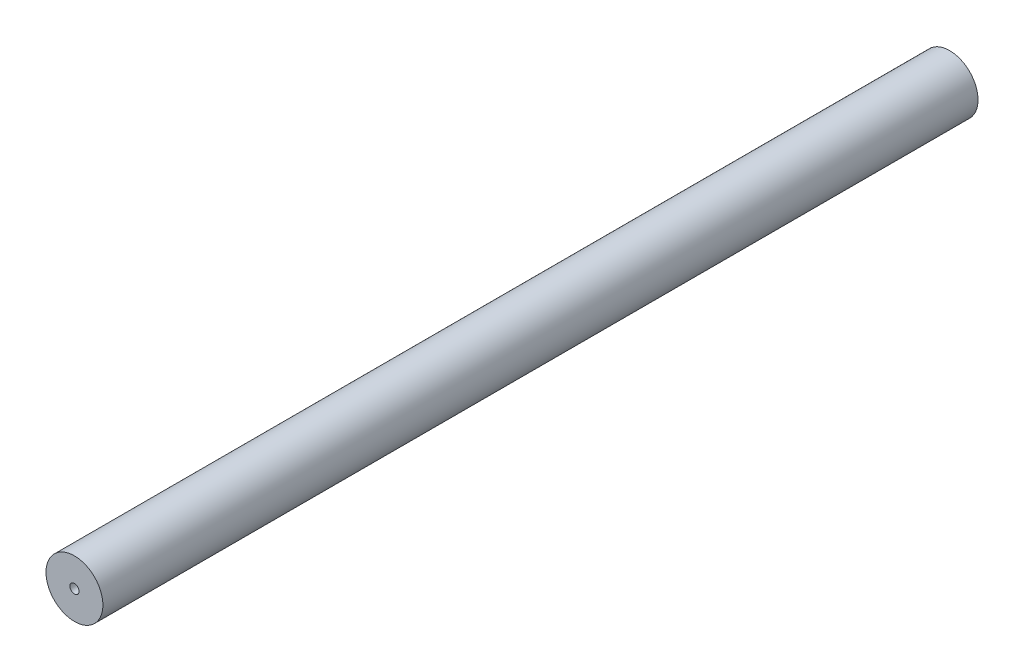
ISO-10303-21;
HEADER;
FILE_DESCRIPTION(('STEP AP214'),'2;1');
FILE_NAME('part.step','',(''),(''),'','','');
FILE_SCHEMA(('AUTOMOTIVE_DESIGN { 1 0 10303 214 1 1 1 1 }'));
ENDSEC;
DATA;
#1=APPLICATION_CONTEXT('core data for automotive mechanical design processes');
#2=APPLICATION_PROTOCOL_DEFINITION('international standard','automotive_design',2000,#1);
#3=PRODUCT_CONTEXT('',#1,'mechanical');
#4=PRODUCT('Part','Part','',(#3));
#5=PRODUCT_RELATED_PRODUCT_CATEGORY('part','',(#4));
#6=PRODUCT_DEFINITION_FORMATION('','',#4);
#7=PRODUCT_DEFINITION_CONTEXT('part definition',#1,'design');
#8=PRODUCT_DEFINITION('design','',#6,#7);
#9=PRODUCT_DEFINITION_SHAPE('','',#8);
#10=(LENGTH_UNIT() NAMED_UNIT(*) SI_UNIT(.MILLI.,.METRE.));
#11=(NAMED_UNIT(*) PLANE_ANGLE_UNIT() SI_UNIT($,.RADIAN.));
#12=(NAMED_UNIT(*) SI_UNIT($,.STERADIAN.) SOLID_ANGLE_UNIT());
#13=UNCERTAINTY_MEASURE_WITH_UNIT(LENGTH_MEASURE(1.E-05),#10,'distance_accuracy_value','');
#14=(GEOMETRIC_REPRESENTATION_CONTEXT(3) GLOBAL_UNCERTAINTY_ASSIGNED_CONTEXT((#13)) GLOBAL_UNIT_ASSIGNED_CONTEXT((#10,
#11,#12)) REPRESENTATION_CONTEXT('',''));
#15=CARTESIAN_POINT('',(0.,0.,0.));
#16=DIRECTION('',(0.,0.,1.));
#17=DIRECTION('',(1.,0.,0.));
#18=AXIS2_PLACEMENT_3D('',#15,#16,#17);
#19=CARTESIAN_POINT('',(0.,0.,387.599999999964));
#20=DIRECTION('',(0.,0.,1.));
#21=DIRECTION('',(0.,-1.,0.));
#22=AXIS2_PLACEMENT_3D('',#19,#20,#21);
#23=CONICAL_SURFACE('',#22,2.0999999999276,1.02974425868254);
#24=CARTESIAN_POINT('',(-1.13686837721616E-10,0.,386.338192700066));
#25=VERTEX_POINT('',#24);
#26=VERTEX_LOOP('',#25);
#27=FACE_BOUND('',#26,.T.);
#28=CARTESIAN_POINT('',(0.,0.,387.6));
#29=DIRECTION('',(0.,0.,1.));
#30=DIRECTION('',(1.,0.,0.));
#31=AXIS2_PLACEMENT_3D('',#28,#29,#30);
#32=CIRCLE('',#31,2.09999999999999);
#33=CARTESIAN_POINT('',(2.09999999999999,0.,387.6));
#34=VERTEX_POINT('',#33);
#35=EDGE_CURVE('E37',#34,#34,#32,.T.);
#36=ORIENTED_EDGE('',*,*,#35,.T.);
#37=EDGE_LOOP('',(#36));
#38=FACE_BOUND('',#37,.T.);
#39=ADVANCED_FACE('F17',(#27,#38),#23,.F.);
#40=CARTESIAN_POINT('',(0.,0.,12.4000000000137));
#41=DIRECTION('',(0.,0.,-1.));
#42=DIRECTION('',(0.,1.,0.));
#43=AXIS2_PLACEMENT_3D('',#40,#41,#42);
#44=CONICAL_SURFACE('',#43,2.10000000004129,1.02974425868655);
#45=CARTESIAN_POINT('',(0.,0.,13.6618072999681));
#46=VERTEX_POINT('',#45);
#47=VERTEX_LOOP('',#46);
#48=FACE_BOUND('',#47,.T.);
#49=CARTESIAN_POINT('',(0.,0.,12.4));
#50=DIRECTION('',(0.,0.,-1.));
#51=DIRECTION('',(-1.,0.,0.));
#52=AXIS2_PLACEMENT_3D('',#49,#50,#51);
#53=CIRCLE('',#52,2.09999999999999);
#54=CARTESIAN_POINT('',(-2.09999999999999,0.,12.4));
#55=VERTEX_POINT('',#54);
#56=EDGE_CURVE('E39',#55,#55,#53,.T.);
#57=ORIENTED_EDGE('',*,*,#56,.T.);
#58=EDGE_LOOP('',(#57));
#59=FACE_BOUND('',#58,.T.);
#60=ADVANCED_FACE('F34',(#48,#59),#44,.F.);
#61=CARTESIAN_POINT('',(0.,0.,400.));
#62=DIRECTION('',(0.,0.,1.));
#63=DIRECTION('',(1.,0.,0.));
#64=AXIS2_PLACEMENT_3D('',#61,#62,#63);
#65=CYLINDRICAL_SURFACE('',#64,2.09999999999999);
#66=CARTESIAN_POINT('',(0.,0.,400.));
#67=DIRECTION('',(0.,0.,1.));
#68=DIRECTION('',(1.,0.,0.));
#69=AXIS2_PLACEMENT_3D('',#66,#67,#68);
#70=CIRCLE('',#69,2.09999999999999);
#71=CARTESIAN_POINT('',(2.09999999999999,0.,400.));
#72=VERTEX_POINT('',#71);
#73=EDGE_CURVE('E20',#72,#72,#70,.F.);
#74=ORIENTED_EDGE('',*,*,#73,.F.);
#75=EDGE_LOOP('',(#74));
#76=FACE_BOUND('',#75,.T.);
#77=ORIENTED_EDGE('',*,*,#35,.F.);
#78=EDGE_LOOP('',(#77));
#79=FACE_BOUND('',#78,.T.);
#80=ADVANCED_FACE('F54',(#76,#79),#65,.F.);
#81=CARTESIAN_POINT('',(0.,0.,0.));
#82=DIRECTION('',(0.,0.,-1.));
#83=DIRECTION('',(-1.,0.,0.));
#84=AXIS2_PLACEMENT_3D('',#81,#82,#83);
#85=CYLINDRICAL_SURFACE('',#84,2.09999999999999);
#86=ORIENTED_EDGE('',*,*,#56,.F.);
#87=EDGE_LOOP('',(#86));
#88=FACE_BOUND('',#87,.T.);
#89=CARTESIAN_POINT('',(0.,0.,0.));
#90=DIRECTION('',(0.,0.,-1.));
#91=DIRECTION('',(-1.,0.,0.));
#92=AXIS2_PLACEMENT_3D('',#89,#90,#91);
#93=CIRCLE('',#92,2.09999999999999);
#94=CARTESIAN_POINT('',(-2.09999999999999,0.,0.));
#95=VERTEX_POINT('',#94);
#96=EDGE_CURVE('E45',#95,#95,#93,.T.);
#97=ORIENTED_EDGE('',*,*,#96,.T.);
#98=EDGE_LOOP('',(#97));
#99=FACE_BOUND('',#98,.T.);
#100=ADVANCED_FACE('F56',(#88,#99),#85,.F.);
#101=CARTESIAN_POINT('',(0.,0.,400.));
#102=DIRECTION('',(0.,0.,1.));
#103=DIRECTION('',(1.,0.,0.));
#104=AXIS2_PLACEMENT_3D('',#101,#102,#103);
#105=PLANE('',#104);
#106=CARTESIAN_POINT('',(0.,0.,400.));
#107=DIRECTION('',(0.,0.,-1.));
#108=DIRECTION('',(-1.,0.,0.));
#109=AXIS2_PLACEMENT_3D('',#106,#107,#108);
#110=CIRCLE('',#109,13.);
#111=CARTESIAN_POINT('',(-13.,0.,400.));
#112=VERTEX_POINT('',#111);
#113=EDGE_CURVE('E26',#112,#112,#110,.T.);
#114=ORIENTED_EDGE('',*,*,#113,.F.);
#115=EDGE_LOOP('',(#114));
#116=FACE_BOUND('',#115,.T.);
#117=ORIENTED_EDGE('',*,*,#73,.T.);
#118=EDGE_LOOP('',(#117));
#119=FACE_BOUND('',#118,.T.);
#120=ADVANCED_FACE('F52',(#116,#119),#105,.T.);
#121=CARTESIAN_POINT('',(0.,0.,0.));
#122=DIRECTION('',(0.,0.,1.));
#123=DIRECTION('',(1.,0.,0.));
#124=AXIS2_PLACEMENT_3D('',#121,#122,#123);
#125=PLANE('',#124);
#126=CARTESIAN_POINT('',(0.,0.,0.));
#127=DIRECTION('',(0.,0.,-1.));
#128=DIRECTION('',(-1.,0.,0.));
#129=AXIS2_PLACEMENT_3D('',#126,#127,#128);
#130=CIRCLE('',#129,13.);
#131=CARTESIAN_POINT('',(-13.,0.,0.));
#132=VERTEX_POINT('',#131);
#133=EDGE_CURVE('E11',#132,#132,#130,.F.);
#134=ORIENTED_EDGE('',*,*,#133,.F.);
#135=EDGE_LOOP('',(#134));
#136=FACE_BOUND('',#135,.T.);
#137=ORIENTED_EDGE('',*,*,#96,.F.);
#138=EDGE_LOOP('',(#137));
#139=FACE_BOUND('',#138,.T.);
#140=ADVANCED_FACE('F67',(#136,#139),#125,.F.);
#141=CARTESIAN_POINT('',(0.,0.,400.));
#142=DIRECTION('',(0.,0.,-1.));
#143=DIRECTION('',(-1.,0.,0.));
#144=AXIS2_PLACEMENT_3D('',#141,#142,#143);
#145=CYLINDRICAL_SURFACE('',#144,13.);
#146=ORIENTED_EDGE('',*,*,#133,.T.);
#147=EDGE_LOOP('',(#146));
#148=FACE_BOUND('',#147,.T.);
#149=ORIENTED_EDGE('',*,*,#113,.T.);
#150=EDGE_LOOP('',(#149));
#151=FACE_BOUND('',#150,.T.);
#152=ADVANCED_FACE('F65',(#148,#151),#145,.T.);
#153=CLOSED_SHELL('',(#39,#60,#80,#100,#120,#140,#152));
#154=MANIFOLD_SOLID_BREP('B1',#153);
#155=ADVANCED_BREP_SHAPE_REPRESENTATION('',(#18,#154),#14);
#156=SHAPE_DEFINITION_REPRESENTATION(#9,#155);
ENDSEC;
END-ISO-10303-21;
